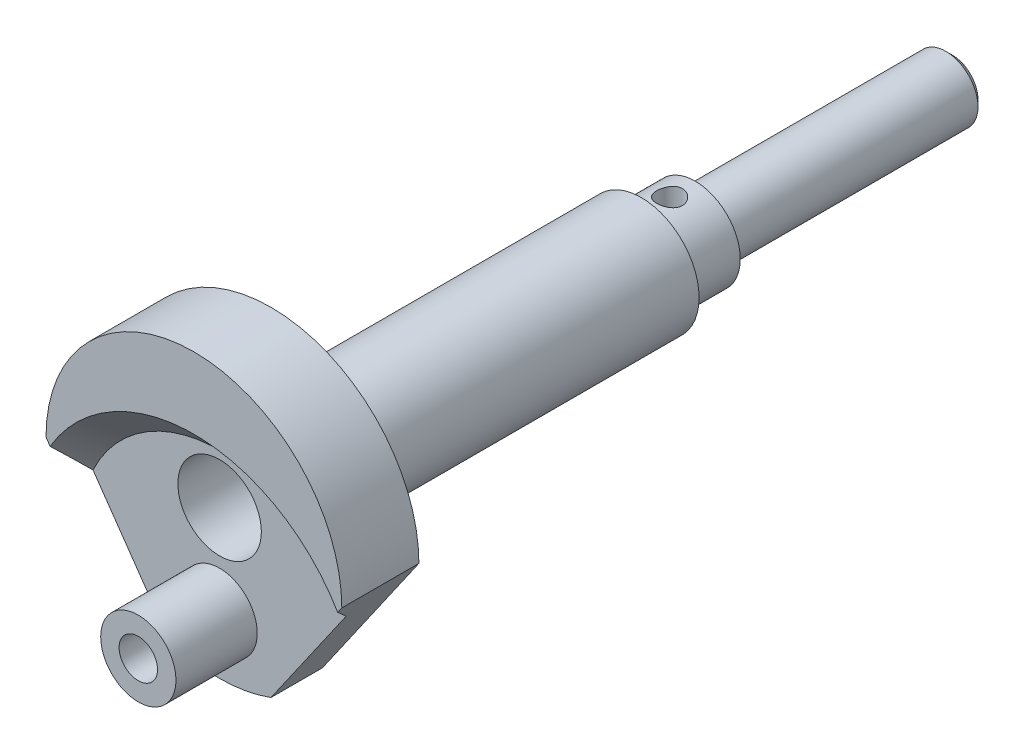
ISO-10303-21;
HEADER;
FILE_DESCRIPTION(('STEP AP214'),'2;1');
FILE_NAME('part.step','',(''),(''),'','','');
FILE_SCHEMA(('AUTOMOTIVE_DESIGN { 1 0 10303 214 1 1 1 1 }'));
ENDSEC;
DATA;
#1=APPLICATION_CONTEXT('core data for automotive mechanical design processes');
#2=APPLICATION_PROTOCOL_DEFINITION('international standard','automotive_design',2000,#1);
#3=PRODUCT_CONTEXT('',#1,'mechanical');
#4=PRODUCT('Part','Part','',(#3));
#5=PRODUCT_RELATED_PRODUCT_CATEGORY('part','',(#4));
#6=PRODUCT_DEFINITION_FORMATION('','',#4);
#7=PRODUCT_DEFINITION_CONTEXT('part definition',#1,'design');
#8=PRODUCT_DEFINITION('design','',#6,#7);
#9=PRODUCT_DEFINITION_SHAPE('','',#8);
#10=(LENGTH_UNIT() NAMED_UNIT(*) SI_UNIT(.MILLI.,.METRE.));
#11=(NAMED_UNIT(*) PLANE_ANGLE_UNIT() SI_UNIT($,.RADIAN.));
#12=(NAMED_UNIT(*) SI_UNIT($,.STERADIAN.) SOLID_ANGLE_UNIT());
#13=UNCERTAINTY_MEASURE_WITH_UNIT(LENGTH_MEASURE(1.E-05),#10,'distance_accuracy_value','');
#14=(GEOMETRIC_REPRESENTATION_CONTEXT(3) GLOBAL_UNCERTAINTY_ASSIGNED_CONTEXT((#13)) GLOBAL_UNIT_ASSIGNED_CONTEXT((#10,
#11,#12)) REPRESENTATION_CONTEXT('',''));
#15=CARTESIAN_POINT('',(0.,0.,0.));
#16=DIRECTION('',(0.,0.,1.));
#17=DIRECTION('',(1.,0.,0.));
#18=AXIS2_PLACEMENT_3D('',#15,#16,#17);
#19=CARTESIAN_POINT('',(0.,0.,-112.217199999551));
#20=DIRECTION('',(0.,0.,1.));
#21=DIRECTION('',(1.,0.,0.));
#22=AXIS2_PLACEMENT_3D('',#19,#20,#21);
#23=PLANE('',#22);
#24=CARTESIAN_POINT('',(0.,0.,-112.217199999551));
#25=DIRECTION('',(0.,0.,1.));
#26=DIRECTION('',(1.,0.,0.));
#27=AXIS2_PLACEMENT_3D('',#24,#25,#26);
#28=CIRCLE('',#27,4.2333333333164);
#29=CARTESIAN_POINT('',(4.2333333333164,0.,-112.217199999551));
#30=VERTEX_POINT('',#29);
#31=EDGE_CURVE('E20',#30,#30,#28,.T.);
#32=ORIENTED_EDGE('',*,*,#31,.F.);
#33=EDGE_LOOP('',(#32));
#34=FACE_BOUND('',#33,.T.);
#35=ADVANCED_FACE('F17',(#34),#23,.F.);
#36=CARTESIAN_POINT('',(0.,0.,-111.167333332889));
#37=DIRECTION('',(0.,0.,1.));
#38=DIRECTION('',(1.,0.,0.));
#39=AXIS2_PLACEMENT_3D('',#36,#37,#38);
#40=CONICAL_SURFACE('',#39,5.28319999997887,0.785398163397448);
#41=CARTESIAN_POINT('',(0.,0.,-111.167333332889));
#42=DIRECTION('',(0.,0.,-1.));
#43=DIRECTION('',(-1.,0.,0.));
#44=AXIS2_PLACEMENT_3D('',#41,#42,#43);
#45=CIRCLE('',#44,5.28319999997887);
#46=CARTESIAN_POINT('',(-5.28319999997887,0.,-111.167333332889));
#47=VERTEX_POINT('',#46);
#48=EDGE_CURVE('E145',#47,#47,#45,.F.);
#49=ORIENTED_EDGE('',*,*,#48,.F.);
#50=EDGE_LOOP('',(#49));
#51=FACE_BOUND('',#50,.T.);
#52=ORIENTED_EDGE('',*,*,#31,.T.);
#53=EDGE_LOOP('',(#52));
#54=FACE_BOUND('',#53,.T.);
#55=ADVANCED_FACE('F269',(#51,#54),#40,.T.);
#56=CARTESIAN_POINT('',(0.,-14.816582,22.5249570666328));
#57=DIRECTION('',(0.,0.,-1.));
#58=DIRECTION('',(-1.,0.,0.));
#59=AXIS2_PLACEMENT_3D('',#56,#57,#58);
#60=CYLINDRICAL_SURFACE('',#59,6.1976);
#61=CARTESIAN_POINT('',(0.,-14.816582,21.8555146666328));
#62=DIRECTION('',(0.,0.,-1.));
#63=DIRECTION('',(-1.,0.,0.));
#64=AXIS2_PLACEMENT_3D('',#61,#62,#63);
#65=CIRCLE('',#64,6.1976);
#66=CARTESIAN_POINT('',(-6.1976,-14.816582,21.8555146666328));
#67=VERTEX_POINT('',#66);
#68=EDGE_CURVE('E141',#67,#67,#65,.T.);
#69=ORIENTED_EDGE('',*,*,#68,.T.);
#70=EDGE_LOOP('',(#69));
#71=FACE_BOUND('',#70,.T.);
#72=CARTESIAN_POINT('',(0.,-14.816582,8.4666666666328));
#73=DIRECTION('',(0.,0.,-1.));
#74=DIRECTION('',(-1.,0.,0.));
#75=AXIS2_PLACEMENT_3D('',#72,#73,#74);
#76=CIRCLE('',#75,6.1976);
#77=CARTESIAN_POINT('',(-6.1976,-14.816582,8.4666666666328));
#78=VERTEX_POINT('',#77);
#79=EDGE_CURVE('E89',#78,#78,#76,.T.);
#80=ORIENTED_EDGE('',*,*,#79,.F.);
#81=EDGE_LOOP('',(#80));
#82=FACE_BOUND('',#81,.T.);
#83=ADVANCED_FACE('F260',(#71,#82),#60,.T.);
#84=CARTESIAN_POINT('',(0.,0.,-29.6333333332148));
#85=DIRECTION('',(0.,0.,1.));
#86=DIRECTION('',(1.,0.,0.));
#87=AXIS2_PLACEMENT_3D('',#84,#85,#86);
#88=CONICAL_SURFACE('',#87,6.87493333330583,1.0471975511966);
#89=CARTESIAN_POINT('',(0.,0.,-29.6333333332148));
#90=DIRECTION('',(0.,0.,1.));
#91=DIRECTION('',(1.,0.,0.));
#92=AXIS2_PLACEMENT_3D('',#89,#90,#91);
#93=CIRCLE('',#92,6.87493333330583);
#94=CARTESIAN_POINT('',(6.87493333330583,0.,-29.6333333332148));
#95=VERTEX_POINT('',#94);
#96=EDGE_CURVE('E137',#95,#95,#93,.T.);
#97=ORIENTED_EDGE('',*,*,#96,.T.);
#98=EDGE_LOOP('',(#97));
#99=FACE_BOUND('',#98,.T.);
#100=CARTESIAN_POINT('',(0.,0.,-33.6025779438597));
#101=VERTEX_POINT('',#100);
#102=VERTEX_LOOP('',#101);
#103=FACE_BOUND('',#102,.T.);
#104=ADVANCED_FACE('F257',(#99,#103),#88,.F.);
#105=CARTESIAN_POINT('',(0.,0.,-67.7671999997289));
#106=DIRECTION('',(0.,0.,-1.));
#107=DIRECTION('',(-1.,0.,0.));
#108=AXIS2_PLACEMENT_3D('',#105,#106,#107);
#109=CYLINDRICAL_SURFACE('',#108,5.28319999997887);
#110=CARTESIAN_POINT('',(0.,0.,-69.8838666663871));
#111=DIRECTION('',(0.,0.,-1.));
#112=DIRECTION('',(-1.,0.,0.));
#113=AXIS2_PLACEMENT_3D('',#110,#111,#112);
#114=CIRCLE('',#113,5.28319999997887);
#115=CARTESIAN_POINT('',(-5.28319999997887,0.,-69.8838666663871));
#116=VERTEX_POINT('',#115);
#117=EDGE_CURVE('E134',#116,#116,#114,.F.);
#118=ORIENTED_EDGE('',*,*,#117,.F.);
#119=EDGE_LOOP('',(#118));
#120=FACE_BOUND('',#119,.T.);
#121=ORIENTED_EDGE('',*,*,#48,.T.);
#122=EDGE_LOOP('',(#121));
#123=FACE_BOUND('',#122,.T.);
#124=ADVANCED_FACE('F259',(#120,#123),#109,.T.);
#125=CARTESIAN_POINT('',(0.,-14.816582,8.4666666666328));
#126=DIRECTION('',(0.,0.,1.));
#127=DIRECTION('',(1.,0.,0.));
#128=AXIS2_PLACEMENT_3D('',#125,#126,#127);
#129=PLANE('',#128);
#130=CARTESIAN_POINT('',(0.,0.,8.4666666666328));
#131=DIRECTION('',(0.,0.,1.));
#132=DIRECTION('',(1.,0.,0.));
#133=AXIS2_PLACEMENT_3D('',#130,#131,#132);
#134=CIRCLE('',#133,6.87493333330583);
#135=CARTESIAN_POINT('',(6.87493333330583,0.,8.4666666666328));
#136=VERTEX_POINT('',#135);
#137=EDGE_CURVE('E138',#136,#136,#134,.F.);
#138=ORIENTED_EDGE('',*,*,#137,.T.);
#139=EDGE_LOOP('',(#138));
#140=FACE_BOUND('',#139,.T.);
#141=ORIENTED_EDGE('',*,*,#79,.T.);
#142=EDGE_LOOP('',(#141));
#143=FACE_BOUND('',#142,.T.);
#144=CARTESIAN_POINT('',(0.,-14.816582,8.46666666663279));
#145=DIRECTION('',(0.,0.,1.));
#146=DIRECTION('',(1.,0.,0.));
#147=AXIS2_PLACEMENT_3D('',#144,#145,#146);
#148=CIRCLE('',#147,23.0293333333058);
#149=CARTESIAN_POINT('',(20.8522411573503,-5.04242052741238,8.4666666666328));
#150=VERTEX_POINT('',#149);
#151=CARTESIAN_POINT('',(-20.8522411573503,-5.04242052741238,8.4666666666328));
#152=VERTEX_POINT('',#151);
#153=EDGE_CURVE('E73',#150,#152,#148,.T.);
#154=ORIENTED_EDGE('',*,*,#153,.T.);
#155=DIRECTION('',(0.571160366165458,-0.820838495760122,0.));
#156=VECTOR('',#155,1.);
#157=CARTESIAN_POINT('',(-8.4666666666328,-22.8422486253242,8.4666666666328));
#158=LINE('',#157,#156);
#159=CARTESIAN_POINT('',(-8.4666666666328,-22.8422486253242,8.4666666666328));
#160=VERTEX_POINT('',#159);
#161=EDGE_CURVE('E133',#160,#152,#158,.F.);
#162=ORIENTED_EDGE('',*,*,#161,.F.);
#163=CARTESIAN_POINT('',(0.,0.,8.4666666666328));
#164=DIRECTION('',(0.,0.,1.));
#165=DIRECTION('',(1.,0.,0.));
#166=AXIS2_PLACEMENT_3D('',#163,#164,#165);
#167=CIRCLE('',#166,24.360886);
#168=CARTESIAN_POINT('',(8.4666666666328,-22.8422486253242,8.4666666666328));
#169=VERTEX_POINT('',#168);
#170=EDGE_CURVE('E76',#169,#160,#167,.F.);
#171=ORIENTED_EDGE('',*,*,#170,.F.);
#172=DIRECTION('',(-0.571160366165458,-0.820838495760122,0.));
#173=VECTOR('',#172,1.);
#174=CARTESIAN_POINT('',(8.4666666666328,-22.8422486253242,8.4666666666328));
#175=LINE('',#174,#173);
#176=EDGE_CURVE('E70',#169,#150,#175,.F.);
#177=ORIENTED_EDGE('',*,*,#176,.T.);
#178=EDGE_LOOP('',(#154,#162,#171,#177));
#179=FACE_BOUND('',#178,.T.);
#180=ADVANCED_FACE('F72',(#140,#143,#179),#129,.T.);
#181=CARTESIAN_POINT('',(0.,-14.816582,12.6999999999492));
#182=DIRECTION('',(0.,0.,1.));
#183=DIRECTION('',(1.,0.,0.));
#184=AXIS2_PLACEMENT_3D('',#181,#182,#183);
#185=CONICAL_SURFACE('',#184,27.4319153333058,0.804993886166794);
#186=CARTESIAN_POINT('',(20.8522411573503,-5.04242052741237,8.4666666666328));
#187=CARTESIAN_POINT('',(21.0907078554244,-4.69971004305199,8.81417631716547));
#188=CARTESIAN_POINT('',(21.3284180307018,-4.35808678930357,9.16327129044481));
#189=CARTESIAN_POINT('',(21.8025008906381,-3.67676244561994,9.86420706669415));
#190=CARTESIAN_POINT('',(22.0388736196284,-3.33706129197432,10.2160477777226));
#191=CARTESIAN_POINT('',(22.510471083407,-2.65930881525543,10.9220705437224));
#192=CARTESIAN_POINT('',(22.7456958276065,-2.32125747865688,11.2762525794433));
#193=CARTESIAN_POINT('',(23.2151468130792,-1.64658979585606,11.9866674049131));
#194=CARTESIAN_POINT('',(23.4493730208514,-1.30997349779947,12.3429002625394));
#195=CARTESIAN_POINT('',(23.6831659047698,-0.97397994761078,12.6999999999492));
#196=B_SPLINE_CURVE_WITH_KNOTS('',3,(#186,#187,#188,#189,#190,#191,#192,#193,#194,#195),
.UNSPECIFIED.,.F.,.F.,(4,2,2,2,4),(0.,1.62962797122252,3.25920160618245,4.88876185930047,
6.51837636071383),.UNSPECIFIED.);
#197=CARTESIAN_POINT('',(23.6831659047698,-0.973979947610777,12.6999999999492));
#198=VERTEX_POINT('',#197);
#199=EDGE_CURVE('E79',#150,#198,#196,.T.);
#200=ORIENTED_EDGE('',*,*,#199,.T.);
#201=CARTESIAN_POINT('',(0.,-14.816582,12.6999999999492));
#202=DIRECTION('',(0.,0.,1.));
#203=DIRECTION('',(1.,0.,0.));
#204=AXIS2_PLACEMENT_3D('',#201,#202,#203);
#205=CIRCLE('',#204,27.4319153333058);
#206=CARTESIAN_POINT('',(-23.6831659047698,-0.973979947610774,12.6999999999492));
#207=VERTEX_POINT('',#206);
#208=EDGE_CURVE('E88',#207,#198,#205,.F.);
#209=ORIENTED_EDGE('',*,*,#208,.F.);
#210=CARTESIAN_POINT('',(-20.8522411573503,-5.04242052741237,8.4666666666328));
#211=CARTESIAN_POINT('',(-21.0907078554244,-4.69971004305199,8.81417631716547));
#212=CARTESIAN_POINT('',(-21.3284180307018,-4.35808678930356,9.16327129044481));
#213=CARTESIAN_POINT('',(-21.8025008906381,-3.67676244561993,9.86420706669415));
#214=CARTESIAN_POINT('',(-22.0388736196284,-3.33706129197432,10.2160477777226));
#215=CARTESIAN_POINT('',(-22.510471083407,-2.65930881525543,10.9220705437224));
#216=CARTESIAN_POINT('',(-22.7456958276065,-2.32125747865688,11.2762525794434));
#217=CARTESIAN_POINT('',(-23.2151468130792,-1.64658979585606,11.9866674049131));
#218=CARTESIAN_POINT('',(-23.4493730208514,-1.30997349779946,12.3429002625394));
#219=CARTESIAN_POINT('',(-23.6831659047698,-0.973979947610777,12.6999999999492));
#220=B_SPLINE_CURVE_WITH_KNOTS('',3,(#210,#211,#212,#213,#214,#215,#216,#217,#218,#219),
.UNSPECIFIED.,.F.,.F.,(4,2,2,2,4),(0.,1.62962797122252,3.25920160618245,4.88876185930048,
6.51837636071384),.UNSPECIFIED.);
#221=EDGE_CURVE('E86',#152,#207,#220,.T.);
#222=ORIENTED_EDGE('',*,*,#221,.F.);
#223=ORIENTED_EDGE('',*,*,#153,.F.);
#224=EDGE_LOOP('',(#200,#209,#222,#223));
#225=FACE_BOUND('',#224,.T.);
#226=ADVANCED_FACE('F83',(#225),#185,.F.);
#227=CARTESIAN_POINT('',(0.,0.,12.6999999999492));
#228=DIRECTION('',(0.,0.,1.));
#229=DIRECTION('',(1.,0.,0.));
#230=AXIS2_PLACEMENT_3D('',#227,#228,#229);
#231=PLANE('',#230);
#232=CARTESIAN_POINT('',(0.,0.,12.6999999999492));
#233=DIRECTION('',(0.,0.,1.));
#234=DIRECTION('',(1.,0.,0.));
#235=AXIS2_PLACEMENT_3D('',#232,#233,#234);
#236=CIRCLE('',#235,24.360886);
#237=CARTESIAN_POINT('',(-24.360886,0.,12.6999999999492));
#238=VERTEX_POINT('',#237);
#239=CARTESIAN_POINT('',(24.360886,0.,12.6999999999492));
#240=VERTEX_POINT('',#239);
#241=EDGE_CURVE('E104',#238,#240,#236,.F.);
#242=ORIENTED_EDGE('',*,*,#241,.F.);
#243=DIRECTION('',(0.571160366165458,-0.820838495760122,0.));
#244=VECTOR('',#243,1.);
#245=CARTESIAN_POINT('',(-8.4666666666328,-22.8422486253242,12.6999999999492));
#246=LINE('',#245,#244);
#247=EDGE_CURVE('E132',#207,#238,#246,.F.);
#248=ORIENTED_EDGE('',*,*,#247,.F.);
#249=ORIENTED_EDGE('',*,*,#208,.T.);
#250=DIRECTION('',(-0.571160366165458,-0.820838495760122,0.));
#251=VECTOR('',#250,1.);
#252=CARTESIAN_POINT('',(8.4666666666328,-22.8422486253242,12.6999999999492));
#253=LINE('',#252,#251);
#254=EDGE_CURVE('E93',#198,#240,#253,.F.);
#255=ORIENTED_EDGE('',*,*,#254,.T.);
#256=EDGE_LOOP('',(#242,#248,#249,#255));
#257=FACE_BOUND('',#256,.T.);
#258=ADVANCED_FACE('F229',(#257),#231,.T.);
#259=CARTESIAN_POINT('',(0.,-14.816582,21.8555146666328));
#260=DIRECTION('',(0.,0.,-1.));
#261=DIRECTION('',(-1.,0.,0.));
#262=AXIS2_PLACEMENT_3D('',#259,#260,#261);
#263=PLANE('',#262);
#264=CARTESIAN_POINT('',(0.,-14.816582,21.8555146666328));
#265=DIRECTION('',(0.,0.,1.));
#266=DIRECTION('',(1.,0.,0.));
#267=AXIS2_PLACEMENT_3D('',#264,#265,#266);
#268=CIRCLE('',#267,3.16653333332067);
#269=CARTESIAN_POINT('',(3.16653333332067,-14.816582,21.8555146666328));
#270=VERTEX_POINT('',#269);
#271=EDGE_CURVE('E213',#270,#270,#268,.F.);
#272=ORIENTED_EDGE('',*,*,#271,.T.);
#273=EDGE_LOOP('',(#272));
#274=FACE_BOUND('',#273,.T.);
#275=ORIENTED_EDGE('',*,*,#68,.F.);
#276=EDGE_LOOP('',(#275));
#277=FACE_BOUND('',#276,.T.);
#278=ADVANCED_FACE('F226',(#274,#277),#263,.F.);
#279=CARTESIAN_POINT('',(0.,0.,-35.7060401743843));
#280=DIRECTION('',(0.,0.,1.));
#281=DIRECTION('',(1.,0.,0.));
#282=AXIS2_PLACEMENT_3D('',#279,#280,#281);
#283=CYLINDRICAL_SURFACE('',#282,6.87493333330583);
#284=ORIENTED_EDGE('',*,*,#137,.F.);
#285=EDGE_LOOP('',(#284));
#286=FACE_BOUND('',#285,.T.);
#287=ORIENTED_EDGE('',*,*,#96,.F.);
#288=EDGE_LOOP('',(#287));
#289=FACE_BOUND('',#288,.T.);
#290=CARTESIAN_POINT('',(2.62703810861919,-6.35321801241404,-12.4459999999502));
#291=CARTESIAN_POINT('',(2.62703500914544,-6.35321984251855,-12.3582359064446));
#292=CARTESIAN_POINT('',(2.62262089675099,-6.35505021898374,-12.2704461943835));
#293=CARTESIAN_POINT('',(2.60526067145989,-6.36218563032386,-12.0958348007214));
#294=CARTESIAN_POINT('',(2.59230785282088,-6.36749339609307,-12.009013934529));
#295=CARTESIAN_POINT('',(2.54161206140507,-6.38797792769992,-11.7505993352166));
#296=CARTESIAN_POINT('',(2.49203957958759,-6.40771083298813,-11.5816369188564));
#297=CARTESIAN_POINT('',(2.38437780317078,-6.44840248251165,-11.29290001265));
#298=CARTESIAN_POINT('',(2.33111210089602,-6.4679554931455,-11.1709784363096));
#299=CARTESIAN_POINT('',(2.21423527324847,-6.50889507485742,-10.9324216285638));
#300=CARTESIAN_POINT('',(2.15061610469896,-6.53028306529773,-10.8157905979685));
#301=CARTESIAN_POINT('',(2.01513531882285,-6.57335568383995,-10.5870717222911));
#302=CARTESIAN_POINT('',(1.94325002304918,-6.59504099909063,-10.4749982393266));
#303=CARTESIAN_POINT('',(1.7929460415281,-6.63748228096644,-10.255117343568));
#304=CARTESIAN_POINT('',(1.71452517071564,-6.65823793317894,-10.1473113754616));
#305=CARTESIAN_POINT('',(1.48236620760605,-6.71501221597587,-9.84417696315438));
#306=CARTESIAN_POINT('',(1.32196906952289,-6.74876714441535,-9.65349926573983));
#307=CARTESIAN_POINT('',(0.986924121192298,-6.80585737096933,-9.28330107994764));
#308=CARTESIAN_POINT('',(0.81226599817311,-6.82918504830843,-9.10378883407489));
#309=CARTESIAN_POINT('',(0.451582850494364,-6.86247370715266,-8.75568699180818));
#310=CARTESIAN_POINT('',(0.265572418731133,-6.87245148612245,-8.58708392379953));
#311=CARTESIAN_POINT('',(-0.116020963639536,-6.87660185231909,-8.26101202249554));
#312=CARTESIAN_POINT('',(-0.311598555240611,-6.87078319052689,-8.10353707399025));
#313=CARTESIAN_POINT('',(-0.659582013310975,-6.84483826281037,-7.83957236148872));
#314=CARTESIAN_POINT('',(-0.810219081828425,-6.82875710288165,-7.73035243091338));
#315=CARTESIAN_POINT('',(-1.11512579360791,-6.78564264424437,-7.51939689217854));
#316=CARTESIAN_POINT('',(-1.26939616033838,-6.75860714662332,-7.41766279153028));
#317=CARTESIAN_POINT('',(-1.73590755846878,-6.65973586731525,-7.12536257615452));
#318=CARTESIAN_POINT('',(-2.05260843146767,-6.57008898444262,-6.94711986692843));
#319=CARTESIAN_POINT('',(-2.62303454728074,-6.3605719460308,-6.66559203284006));
#320=CARTESIAN_POINT('',(-2.87645277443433,-6.25057205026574,-6.5544342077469));
#321=CARTESIAN_POINT('',(-3.25209421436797,-6.05874829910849,-6.41242359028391));
#322=CARTESIAN_POINT('',(-3.37659502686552,-5.99031319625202,-6.36919899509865));
#323=CARTESIAN_POINT('',(-3.62309037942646,-5.84451834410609,-6.29166528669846));
#324=CARTESIAN_POINT('',(-3.74508599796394,-5.76716253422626,-6.25735225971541));
#325=CARTESIAN_POINT('',(-3.98635375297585,-5.60313534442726,-6.19803417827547));
#326=CARTESIAN_POINT('',(-4.10560018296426,-5.516401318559,-6.17309742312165));
#327=CARTESIAN_POINT('',(-4.33929229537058,-5.33452603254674,-6.13337524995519));
#328=CARTESIAN_POINT('',(-4.45373796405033,-5.23938474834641,-6.11858986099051));
#329=CARTESIAN_POINT('',(-4.6766372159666,-5.04142662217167,-6.09949013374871));
#330=CARTESIAN_POINT('',(-4.78509311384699,-4.93861278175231,-6.09517172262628));
#331=CARTESIAN_POINT('',(-4.99501545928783,-4.72618466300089,-6.09709002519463));
#332=CARTESIAN_POINT('',(-5.09648250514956,-4.61657096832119,-6.10332583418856));
#333=CARTESIAN_POINT('',(-5.28083441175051,-4.40398291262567,-6.12495185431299));
#334=CARTESIAN_POINT('',(-5.36453589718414,-4.30160297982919,-6.13926057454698));
#335=CARTESIAN_POINT('',(-5.52528737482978,-4.09307286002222,-6.17589086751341));
#336=CARTESIAN_POINT('',(-5.60233517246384,-3.98692144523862,-6.19821507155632));
#337=CARTESIAN_POINT('',(-5.74941549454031,-3.77172470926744,-6.25052169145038));
#338=CARTESIAN_POINT('',(-5.81944947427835,-3.66267999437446,-6.28050251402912));
#339=CARTESIAN_POINT('',(-5.95237292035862,-3.4424611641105,-6.34768718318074));
#340=CARTESIAN_POINT('',(-6.01525956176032,-3.33128622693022,-6.38489387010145));
#341=CARTESIAN_POINT('',(-6.1978700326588,-2.98669117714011,-6.50992078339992));
#342=CARTESIAN_POINT('',(-6.3056586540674,-2.75087355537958,-6.60901765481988));
#343=CARTESIAN_POINT('',(-6.49102567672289,-2.27940511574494,-6.83171728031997));
#344=CARTESIAN_POINT('',(-6.56860267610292,-2.04375430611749,-6.95532117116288));
#345=CARTESIAN_POINT('',(-6.7179573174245,-1.49643820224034,-7.26890369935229));
#346=CARTESIAN_POINT('',(-6.77862973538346,-1.18640833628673,-7.46711037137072));
#347=CARTESIAN_POINT('',(-6.83751168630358,-0.732545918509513,-7.78624593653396));
#348=CARTESIAN_POINT('',(-6.85178051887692,-0.58282073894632,-7.89651576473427));
#349=CARTESIAN_POINT('',(-6.87049095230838,-0.287868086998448,-8.12370810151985));
#350=CARTESIAN_POINT('',(-6.87493420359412,-0.142639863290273,-8.24062948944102));
#351=CARTESIAN_POINT('',(-6.87493206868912,0.20727011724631,-8.53503353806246));
#352=CARTESIAN_POINT('',(-6.86554703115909,0.409074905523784,-8.7159525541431));
#353=CARTESIAN_POINT('',(-6.83109565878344,0.79956583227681,-9.09040964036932));
#354=CARTESIAN_POINT('',(-6.80601018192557,0.988235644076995,-9.28396285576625));
#355=CARTESIAN_POINT('',(-6.74383898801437,1.34851895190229,-9.6836882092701));
#356=CARTESIAN_POINT('',(-6.70678835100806,1.52018041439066,-9.88982204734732));
#357=CARTESIAN_POINT('',(-6.64615893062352,1.7607293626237,-10.2104357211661));
#358=CARTESIAN_POINT('',(-6.62512513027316,1.8380351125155,-10.3191204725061));
#359=CARTESIAN_POINT('',(-6.58233154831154,1.98582700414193,-10.5408713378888));
#360=CARTESIAN_POINT('',(-6.56057211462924,2.05631635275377,-10.6539353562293));
#361=CARTESIAN_POINT('',(-6.52430502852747,2.1680522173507,-10.8489015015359));
#362=CARTESIAN_POINT('',(-6.50965903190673,2.21154663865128,-10.929482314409));
#363=CARTESIAN_POINT('',(-6.48115189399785,2.29374634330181,-11.0931668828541));
#364=CARTESIAN_POINT('',(-6.46729082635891,2.3324511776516,-11.1762708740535));
#365=CARTESIAN_POINT('',(-6.42792914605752,2.43971241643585,-11.4290367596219));
#366=CARTESIAN_POINT('',(-6.40449692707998,2.49986858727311,-11.6029096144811));
#367=CARTESIAN_POINT('',(-6.37624441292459,2.5708117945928,-11.8896918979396));
#368=CARTESIAN_POINT('',(-6.36772879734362,2.59170898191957,-11.9997362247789));
#369=CARTESIAN_POINT('',(-6.35621957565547,2.61981393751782,-12.2218647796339));
#370=CARTESIAN_POINT('',(-6.35322216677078,2.62703113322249,-12.33394754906));
#371=CARTESIAN_POINT('',(-6.35321475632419,2.62704357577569,-12.5338241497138));
#372=CARTESIAN_POINT('',(-6.35505027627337,2.62261975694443,-12.6216296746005));
#373=CARTESIAN_POINT('',(-6.36219274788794,2.60524435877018,-12.7962646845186));
#374=CARTESIAN_POINT('',(-6.36750123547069,2.59228900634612,-12.8830937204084));
#375=CARTESIAN_POINT('',(-6.38798557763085,2.54159201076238,-13.1414797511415));
#376=CARTESIAN_POINT('',(-6.40771563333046,2.4920266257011,-13.3104001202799));
#377=CARTESIAN_POINT('',(-6.44840897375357,2.38436082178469,-13.5991437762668));
#378=CARTESIAN_POINT('',(-6.46796959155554,2.33107382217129,-13.7211086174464));
#379=CARTESIAN_POINT('',(-6.50892482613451,2.21414835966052,-13.9597468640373));
#380=CARTESIAN_POINT('',(-6.53032084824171,2.15050193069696,-14.0764161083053));
#381=CARTESIAN_POINT('',(-6.57340036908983,2.01499007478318,-14.3051594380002));
#382=CARTESIAN_POINT('',(-6.5950844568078,1.9431043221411,-14.417221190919));
#383=CARTESIAN_POINT('',(-6.63750816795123,1.79284612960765,-14.6370225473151));
#384=CARTESIAN_POINT('',(-6.65824801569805,1.714475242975,-14.744763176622));
#385=CARTESIAN_POINT('',(-6.70699474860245,1.51516357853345,-15.0049852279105));
#386=CARTESIAN_POINT('',(-6.73397362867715,1.3911797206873,-15.1553309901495));
#387=CARTESIAN_POINT('',(-6.78202757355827,1.1340024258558,-15.4489556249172));
#388=CARTESIAN_POINT('',(-6.80310080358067,1.00080614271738,-15.5922322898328));
#389=CARTESIAN_POINT('',(-6.83780016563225,0.72680900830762,-15.8720090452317));
#390=CARTESIAN_POINT('',(-6.85143327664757,0.586015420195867,-16.0085153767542));
#391=CARTESIAN_POINT('',(-6.87000016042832,0.297781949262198,-16.2749402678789));
#392=CARTESIAN_POINT('',(-6.87493411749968,0.150342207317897,-16.4048589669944));
#393=CARTESIAN_POINT('',(-6.87493253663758,-0.15273375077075,-16.6598682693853));
#394=CARTESIAN_POINT('',(-6.86983875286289,-0.308463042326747,-16.7848491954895));
#395=CARTESIAN_POINT('',(-6.84830576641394,-0.624995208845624,-17.0271226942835));
#396=CARTESIAN_POINT('',(-6.83186541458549,-0.785798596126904,-17.144414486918));
#397=CARTESIAN_POINT('',(-6.76378394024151,-1.27427989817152,-17.4833495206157));
#398=CARTESIAN_POINT('',(-6.69339080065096,-1.60857360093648,-17.6925110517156));
#399=CARTESIAN_POINT('',(-6.51582497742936,-2.21000362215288,-18.0255874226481));
#400=CARTESIAN_POINT('',(-6.42017294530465,-2.47570862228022,-18.1581308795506));
#401=CARTESIAN_POINT('',(-6.24777718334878,-2.87242656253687,-18.3322056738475));
#402=CARTESIAN_POINT('',(-6.18547505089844,-3.00438874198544,-18.3861165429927));
#403=CARTESIAN_POINT('',(-6.05105872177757,-3.26666177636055,-18.4848861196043));
#404=CARTESIAN_POINT('',(-5.97894888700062,-3.39697333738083,-18.5297488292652));
#405=CARTESIAN_POINT('',(-5.82421647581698,-3.65597800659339,-18.6100156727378));
#406=CARTESIAN_POINT('',(-5.74150390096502,-3.78464546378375,-18.6453296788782));
#407=CARTESIAN_POINT('',(-5.56636317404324,-4.037820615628,-18.7052412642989));
#408=CARTESIAN_POINT('',(-5.47393497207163,-4.1623282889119,-18.7298387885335));
#409=CARTESIAN_POINT('',(-5.27999542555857,-4.40574117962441,-18.7677554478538));
#410=CARTESIAN_POINT('',(-5.17849020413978,-4.52465009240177,-18.7810821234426));
#411=CARTESIAN_POINT('',(-4.967201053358,-4.75563989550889,-18.7961668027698));
#412=CARTESIAN_POINT('',(-4.857418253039,-4.86772171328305,-18.7979263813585));
#413=CARTESIAN_POINT('',(-4.64631428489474,-5.06899620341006,-18.7904008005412));
#414=CARTESIAN_POINT('',(-4.54591208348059,-5.15921457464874,-18.7826043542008));
#415=CARTESIAN_POINT('',(-4.34054199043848,-5.33315252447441,-18.7585269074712));
#416=CARTESIAN_POINT('',(-4.2355726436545,-5.41687000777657,-18.7422431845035));
#417=CARTESIAN_POINT('',(-4.02199467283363,-5.57728368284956,-18.701471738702));
#418=CARTESIAN_POINT('',(-3.91338741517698,-5.65398247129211,-18.6769870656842));
#419=CARTESIAN_POINT('',(-3.6933448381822,-5.80011975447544,-18.6202083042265));
#420=CARTESIAN_POINT('',(-3.58190845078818,-5.86955545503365,-18.5879112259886));
#421=CARTESIAN_POINT('',(-3.24410154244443,-6.06700062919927,-18.479815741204));
#422=CARTESIAN_POINT('',(-3.01462563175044,-6.18385647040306,-18.3928898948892));
#423=CARTESIAN_POINT('',(-2.55370493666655,-6.3880379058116,-18.1937690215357));
#424=CARTESIAN_POINT('',(-2.32225923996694,-6.47534895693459,-18.0815615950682));
#425=CARTESIAN_POINT('',(-1.92110515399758,-6.60350882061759,-17.8676100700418));
#426=CARTESIAN_POINT('',(-1.75079194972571,-6.65053090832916,-17.7705673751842));
#427=CARTESIAN_POINT('',(-1.41298024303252,-6.73040249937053,-17.5662786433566));
#428=CARTESIAN_POINT('',(-1.24548204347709,-6.76325048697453,-17.4590315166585));
#429=CARTESIAN_POINT('',(-0.914155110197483,-6.81595423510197,-17.2353528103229));
#430=CARTESIAN_POINT('',(-0.750334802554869,-6.83578262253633,-17.1189024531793));
#431=CARTESIAN_POINT('',(-0.427716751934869,-6.8635249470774,-16.8779904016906));
#432=CARTESIAN_POINT('',(-0.268918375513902,-6.87144039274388,-16.7535297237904));
#433=CARTESIAN_POINT('',(0.046419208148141,-6.87662639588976,-16.4942782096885));
#434=CARTESIAN_POINT('',(0.202819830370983,-6.87364493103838,-16.3593143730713));
#435=CARTESIAN_POINT('',(0.508481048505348,-6.85781108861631,-16.0820820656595));
#436=CARTESIAN_POINT('',(0.657741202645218,-6.84495810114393,-15.9398131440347));
#437=CARTESIAN_POINT('',(0.947797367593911,-6.81084942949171,-15.6481302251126));
#438=CARTESIAN_POINT('',(1.08860186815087,-6.7896023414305,-15.4987236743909));
#439=CARTESIAN_POINT('',(1.36021304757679,-6.74044344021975,-15.1922422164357));
#440=CARTESIAN_POINT('',(1.49102379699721,-6.71253435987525,-15.0351704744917));
#441=CARTESIAN_POINT('',(1.75352722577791,-6.64904796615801,-14.6950650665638));
#442=CARTESIAN_POINT('',(1.88384810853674,-6.61297170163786,-14.5110430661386));
#443=CARTESIAN_POINT('',(2.06345621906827,-6.55826367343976,-14.2251513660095));
#444=CARTESIAN_POINT('',(2.12068160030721,-6.5399281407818,-14.1282078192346));
#445=CARTESIAN_POINT('',(2.2286100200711,-6.50393998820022,-13.930651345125));
#446=CARTESIAN_POINT('',(2.27931507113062,-6.48628715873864,-13.8300395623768));
#447=CARTESIAN_POINT('',(2.39427624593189,-6.4449493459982,-13.5773891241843));
#448=CARTESIAN_POINT('',(2.45398609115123,-6.4222405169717,-13.4230465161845));
#449=CARTESIAN_POINT('',(2.54940844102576,-6.38497914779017,-13.1063334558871));
#450=CARTESIAN_POINT('',(2.58521936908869,-6.37039319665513,-12.9439989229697));
#451=CARTESIAN_POINT('',(2.6129379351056,-6.35903303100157,-12.7243270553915));
#452=CARTESIAN_POINT('',(2.61820917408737,-6.35686240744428,-12.6688226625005));
#453=CARTESIAN_POINT('',(2.62526025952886,-6.3539543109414,-12.5575489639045));
#454=CARTESIAN_POINT('',(2.62704007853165,-6.35321684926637,-12.5017796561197));
#455=CARTESIAN_POINT('',(2.62703810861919,-6.35321801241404,-12.4459999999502));
#456=B_SPLINE_CURVE_WITH_KNOTS('',3,(#290,#291,#292,#293,#294,#295,#296,#297,#298,#299,#300,
#301,#302,#303,#304,#305,#306,#307,#308,#309,#310,#311,#312,#313,#314,#315,#316,#317,#318,#319,
#320,#321,#322,#323,#324,#325,#326,#327,#328,#329,#330,#331,#332,#333,#334,#335,#336,#337,#338,
#339,#340,#341,#342,#343,#344,#345,#346,#347,#348,#349,#350,#351,#352,#353,#354,#355,#356,#357,
#358,#359,#360,#361,#362,#363,#364,#365,#366,#367,#368,#369,#370,#371,#372,#373,#374,#375,#376,
#377,#378,#379,#380,#381,#382,#383,#384,#385,#386,#387,#388,#389,#390,#391,#392,#393,#394,#395,
#396,#397,#398,#399,#400,#401,#402,#403,#404,#405,#406,#407,#408,#409,#410,#411,#412,#413,#414,
#415,#416,#417,#418,#419,#420,#421,#422,#423,#424,#425,#426,#427,#428,#429,#430,#431,#432,#433,
#434,#435,#436,#437,#438,#439,#440,#441,#442,#443,#444,#445,#446,#447,#448,#449,#450,#451,#452,
#453,#454,#455),.UNSPECIFIED.,.T.,.F.,(4,2,2,2,2,2,2,2,2,2,2,2,2,2,2,2,2,2,2,2,2,2,2,2,2,2,2,2,
2,2,2,2,2,2,2,2,2,2,2,2,2,2,2,2,2,2,2,2,2,2,2,2,2,2,2,2,2,2,2,2,2,2,2,2,2,2,2,2,2,2,2,2,2,2,2,2,
2,2,2,2,2,2,4),(0.,0.263206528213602,0.526620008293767,1.05516501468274,1.45810392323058,
1.86135736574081,2.26579614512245,2.6703706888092,3.42364957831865,4.17747810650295,
4.93035723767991,5.68281937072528,6.2426064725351,6.80250599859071,7.91946591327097,
8.8090015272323,9.25402165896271,9.6988460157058,10.1468505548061,10.5948563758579,
11.0426878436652,11.4904809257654,11.889057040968,12.2877641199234,12.6863882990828,
13.0851694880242,13.9144747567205,14.7438185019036,15.8574751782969,16.4166481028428,
16.9757270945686,17.7881252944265,18.6015159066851,19.4125431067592,19.817429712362,
20.2221248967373,20.5001687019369,20.778238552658,21.3317085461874,21.6678899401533,
22.0038395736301,22.2671492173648,22.5305753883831,23.0590048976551,23.4620881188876,
23.8654827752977,24.269894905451,24.6742104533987,25.2639034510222,25.8537794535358,
26.4431011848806,27.0324104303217,27.6310940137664,28.2298382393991,29.4252113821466,
30.3572122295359,30.8234223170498,31.2894257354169,31.7596851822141,32.2299470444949,
32.6998940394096,33.1697770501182,33.574903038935,33.9801590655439,34.3852645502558,
34.7905253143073,35.6025144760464,36.4149027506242,37.0188639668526,37.622889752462,
38.2281814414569,38.8333964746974,39.4526964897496,40.0720347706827,40.6907404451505,
41.3091927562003,41.9930970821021,42.3350707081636,42.6769385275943,43.1765868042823,
43.6741644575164,43.8414476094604,44.0087320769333),.UNSPECIFIED.);
#457=CARTESIAN_POINT('',(2.62703810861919,-6.35321801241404,-12.4459999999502));
#458=VERTEX_POINT('',#457);
#459=EDGE_CURVE('E209',#458,#458,#456,.T.);
#460=ORIENTED_EDGE('',*,*,#459,.T.);
#461=EDGE_LOOP('',(#460));
#462=FACE_BOUND('',#461,.T.);
#463=ADVANCED_FACE('F221',(#286,#289,#462),#283,.F.);
#464=CARTESIAN_POINT('',(0.,0.,-69.8838666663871));
#465=DIRECTION('',(0.,0.,-1.));
#466=DIRECTION('',(-1.,0.,0.));
#467=AXIS2_PLACEMENT_3D('',#464,#465,#466);
#468=PLANE('',#467);
#469=ORIENTED_EDGE('',*,*,#117,.T.);
#470=EDGE_LOOP('',(#469));
#471=FACE_BOUND('',#470,.T.);
#472=CARTESIAN_POINT('',(0.,0.,-69.8838666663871));
#473=DIRECTION('',(0.,0.,-1.));
#474=DIRECTION('',(-1.,0.,0.));
#475=AXIS2_PLACEMENT_3D('',#472,#473,#474);
#476=CIRCLE('',#475,7.4083333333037);
#477=CARTESIAN_POINT('',(-7.4083333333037,0.,-69.8838666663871));
#478=VERTEX_POINT('',#477);
#479=EDGE_CURVE('E203',#478,#478,#476,.F.);
#480=ORIENTED_EDGE('',*,*,#479,.F.);
#481=EDGE_LOOP('',(#480));
#482=FACE_BOUND('',#481,.T.);
#483=ADVANCED_FACE('F225',(#471,#482),#468,.T.);
#484=CARTESIAN_POINT('',(0.,-29.2330632,-65.6505333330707));
#485=DIRECTION('',(0.,1.,0.));
#486=DIRECTION('',(0.,0.,1.));
#487=AXIS2_PLACEMENT_3D('',#484,#485,#486);
#488=CYLINDRICAL_SURFACE('',#487,2.1166666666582);
#489=CARTESIAN_POINT('',(0.,7.4083333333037,-63.5338666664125));
#490=CARTESIAN_POINT('',(-0.11631233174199,7.40833005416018,-63.5338716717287));
#491=CARTESIAN_POINT('',(-0.232687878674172,7.40556597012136,-63.5434905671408));
#492=CARTESIAN_POINT('',(-0.462109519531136,7.39480117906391,-63.5816489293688));
#493=CARTESIAN_POINT('',(-0.575152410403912,7.38679559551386,-63.6102060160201));
#494=CARTESIAN_POINT('',(-0.794501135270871,7.36642982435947,-63.6852195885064));
#495=CARTESIAN_POINT('',(-0.900817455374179,7.35407662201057,-63.7316473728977));
#496=CARTESIAN_POINT('',(-1.10413976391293,7.32631021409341,-63.8409802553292));
#497=CARTESIAN_POINT('',(-1.20114603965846,7.31089710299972,-63.903884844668));
#498=CARTESIAN_POINT('',(-1.38566033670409,7.2782101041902,-64.0461295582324));
#499=CARTESIAN_POINT('',(-1.47288978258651,7.26090085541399,-64.1258228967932));
#500=CARTESIAN_POINT('',(-1.63296334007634,7.2265864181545,-64.2986507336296));
#501=CARTESIAN_POINT('',(-1.70580237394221,7.20958133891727,-64.3917899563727));
#502=CARTESIAN_POINT('',(-1.83644995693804,7.17742884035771,-64.5911814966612));
#503=CARTESIAN_POINT('',(-1.89391987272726,7.16232663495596,-64.6976634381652));
#504=CARTESIAN_POINT('',(-1.98997259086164,7.13623939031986,-64.9192148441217));
#505=CARTESIAN_POINT('',(-2.02857796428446,7.1252494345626,-65.0342738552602));
#506=CARTESIAN_POINT('',(-2.07683819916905,7.11129745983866,-65.2333314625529));
#507=CARTESIAN_POINT('',(-2.09174596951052,7.1069057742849,-65.3159939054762));
#508=CARTESIAN_POINT('',(-2.11166176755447,7.10101365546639,-65.4826043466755));
#509=CARTESIAN_POINT('',(-2.11667034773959,7.09951306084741,-65.566552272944));
#510=CARTESIAN_POINT('',(-2.11666157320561,7.09951965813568,-65.7667365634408));
#511=CARTESIAN_POINT('',(-2.10706010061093,7.10240179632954,-65.8830032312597));
#512=CARTESIAN_POINT('',(-2.06897724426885,7.11358649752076,-66.1121983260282));
#513=CARTESIAN_POINT('',(-2.04047785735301,7.1218942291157,-66.225123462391));
#514=CARTESIAN_POINT('',(-1.96563283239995,7.14291170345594,-66.4442225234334));
#515=CARTESIAN_POINT('',(-1.91931852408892,7.15561371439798,-66.5504079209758));
#516=CARTESIAN_POINT('',(-1.81025342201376,7.18397847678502,-66.7535077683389));
#517=CARTESIAN_POINT('',(-1.74750287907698,7.19964118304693,-66.8504223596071));
#518=CARTESIAN_POINT('',(-1.60541956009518,7.23266719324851,-67.0350264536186));
#519=CARTESIAN_POINT('',(-1.52569885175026,7.25006407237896,-67.1224114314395));
#520=CARTESIAN_POINT('',(-1.35274935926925,7.2843140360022,-67.2827890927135));
#521=CARTESIAN_POINT('',(-1.25951627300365,7.30116694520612,-67.3557771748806));
#522=CARTESIAN_POINT('',(-1.06002909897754,7.33281144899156,-67.4865922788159));
#523=CARTESIAN_POINT('',(-0.953561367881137,7.34755782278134,-67.5441050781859));
#524=CARTESIAN_POINT('',(-0.732039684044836,7.37291636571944,-67.640241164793));
#525=CARTESIAN_POINT('',(-0.616995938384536,7.3835333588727,-67.6788865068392));
#526=CARTESIAN_POINT('',(-0.417834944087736,7.39699478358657,-67.7272499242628));
#527=CARTESIAN_POINT('',(-0.3350448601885,7.40122407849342,-67.7422036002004));
#528=CARTESIAN_POINT('',(-0.168180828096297,7.40689447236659,-67.7621802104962));
#529=CARTESIAN_POINT('',(-0.0841069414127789,7.40833570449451,-67.7672036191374));
#530=CARTESIAN_POINT('',(0.11631233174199,7.40833005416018,-67.7671949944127));
#531=CARTESIAN_POINT('',(0.232687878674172,7.40556597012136,-67.7575760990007));
#532=CARTESIAN_POINT('',(0.462109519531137,7.39480117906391,-67.7194177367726));
#533=CARTESIAN_POINT('',(0.575152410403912,7.38679559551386,-67.6908606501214));
#534=CARTESIAN_POINT('',(0.794501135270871,7.36642982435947,-67.615847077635));
#535=CARTESIAN_POINT('',(0.900817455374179,7.35407662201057,-67.5694192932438));
#536=CARTESIAN_POINT('',(1.10413976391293,7.32631021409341,-67.4600864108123));
#537=CARTESIAN_POINT('',(1.20114603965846,7.31089710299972,-67.3971818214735));
#538=CARTESIAN_POINT('',(1.38566033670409,7.2782101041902,-67.254937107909));
#539=CARTESIAN_POINT('',(1.47288978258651,7.26090085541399,-67.1752437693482));
#540=CARTESIAN_POINT('',(1.63296334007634,7.2265864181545,-67.0024159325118));
#541=CARTESIAN_POINT('',(1.70580237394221,7.20958133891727,-66.9092767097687));
#542=CARTESIAN_POINT('',(1.83644995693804,7.17742884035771,-66.7098851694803));
#543=CARTESIAN_POINT('',(1.89391987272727,7.16232663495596,-66.6034032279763));
#544=CARTESIAN_POINT('',(1.98997259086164,7.13623939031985,-66.3818518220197));
#545=CARTESIAN_POINT('',(2.02857796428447,7.1252494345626,-66.2667928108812));
#546=CARTESIAN_POINT('',(2.07683819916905,7.11129745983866,-66.0677352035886));
#547=CARTESIAN_POINT('',(2.09174596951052,7.1069057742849,-65.9850727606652));
#548=CARTESIAN_POINT('',(2.11166176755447,7.1010136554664,-65.8184623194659));
#549=CARTESIAN_POINT('',(2.11667034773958,7.09951306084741,-65.7345143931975));
#550=CARTESIAN_POINT('',(2.11666157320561,7.09951965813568,-65.5343301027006));
#551=CARTESIAN_POINT('',(2.10706010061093,7.10240179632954,-65.4180634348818));
#552=CARTESIAN_POINT('',(2.06897724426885,7.11358649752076,-65.1888683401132));
#553=CARTESIAN_POINT('',(2.04047785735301,7.1218942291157,-65.0759432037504));
#554=CARTESIAN_POINT('',(1.96563283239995,7.14291170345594,-64.856844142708));
#555=CARTESIAN_POINT('',(1.91931852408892,7.15561371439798,-64.7506587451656));
#556=CARTESIAN_POINT('',(1.81025342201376,7.18397847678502,-64.5475588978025));
#557=CARTESIAN_POINT('',(1.74750287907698,7.19964118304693,-64.4506443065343));
#558=CARTESIAN_POINT('',(1.60541956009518,7.23266719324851,-64.2660402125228));
#559=CARTESIAN_POINT('',(1.52569885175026,7.25006407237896,-64.1786552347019));
#560=CARTESIAN_POINT('',(1.35274935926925,7.2843140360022,-64.018277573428));
#561=CARTESIAN_POINT('',(1.25951627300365,7.30116694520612,-63.9452894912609));
#562=CARTESIAN_POINT('',(1.06002909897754,7.33281144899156,-63.8144743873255));
#563=CARTESIAN_POINT('',(0.953561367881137,7.34755782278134,-63.7569615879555));
#564=CARTESIAN_POINT('',(0.732039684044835,7.37291636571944,-63.6608255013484));
#565=CARTESIAN_POINT('',(0.616995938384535,7.3835333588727,-63.6221801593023));
#566=CARTESIAN_POINT('',(0.417834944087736,7.39699478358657,-63.5738167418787));
#567=CARTESIAN_POINT('',(0.3350448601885,7.40122407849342,-63.558863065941));
#568=CARTESIAN_POINT('',(0.168180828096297,7.40689447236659,-63.5388864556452));
#569=CARTESIAN_POINT('',(0.0841069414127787,7.40833570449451,-63.533863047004));
#570=CARTESIAN_POINT('',(0.,7.4083333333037,-63.5338666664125));
#571=B_SPLINE_CURVE_WITH_KNOTS('',3,(#489,#490,#491,#492,#493,#494,#495,#496,#497,#498,#499,
#500,#501,#502,#503,#504,#505,#506,#507,#508,#509,#510,#511,#512,#513,#514,#515,#516,#517,#518,
#519,#520,#521,#522,#523,#524,#525,#526,#527,#528,#529,#530,#531,#532,#533,#534,#535,#536,#537,
#538,#539,#540,#541,#542,#543,#544,#545,#546,#547,#548,#549,#550,#551,#552,#553,#554,#555,#556,
#557,#558,#559,#560,#561,#562,#563,#564,#565,#566,#567,#568,#569,#570),.UNSPECIFIED.,.T.,.F.,(4,
2,2,2,2,2,2,2,2,2,2,2,2,2,2,2,2,2,2,2,2,2,2,2,2,2,2,2,2,2,2,2,2,2,2,2,2,2,2,2,4),(0.,
0.348623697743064,0.697572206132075,1.04596260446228,1.39434224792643,1.75095325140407,
2.10768986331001,2.47173755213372,2.83534859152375,3.08707891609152,3.33879519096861,
3.68709091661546,4.03571892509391,4.38373661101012,4.73174898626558,5.08878914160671,
5.44594322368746,5.80987952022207,6.1733893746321,6.42549569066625,6.67758996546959,
7.02621366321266,7.37516217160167,7.72355256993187,8.07193221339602,8.42854321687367,
8.7852798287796,9.14932751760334,9.51293855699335,9.76466888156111,10.0163851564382,
10.364680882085,10.7133088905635,11.0613265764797,11.4093389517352,11.7663791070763,
12.123533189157,12.4874694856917,12.8509793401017,13.1030856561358,13.3551799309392),.UNSPECIFIED.);
#572=CARTESIAN_POINT('',(0.,7.4083333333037,-63.5338666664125));
#573=VERTEX_POINT('',#572);
#574=EDGE_CURVE('E191',#573,#573,#571,.T.);
#575=ORIENTED_EDGE('',*,*,#574,.F.);
#576=EDGE_LOOP('',(#575));
#577=FACE_BOUND('',#576,.T.);
#578=CARTESIAN_POINT('',(2.1166666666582,-7.09951582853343,-65.6505333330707));
#579=CARTESIAN_POINT('',(2.11666157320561,-7.09951965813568,-65.7667365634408));
#580=CARTESIAN_POINT('',(2.10706010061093,-7.10240179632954,-65.8830032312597));
#581=CARTESIAN_POINT('',(2.06897724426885,-7.11358649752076,-66.1121983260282));
#582=CARTESIAN_POINT('',(2.04047785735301,-7.1218942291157,-66.225123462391));
#583=CARTESIAN_POINT('',(1.96563283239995,-7.14291170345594,-66.4442225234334));
#584=CARTESIAN_POINT('',(1.91931852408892,-7.15561371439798,-66.5504079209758));
#585=CARTESIAN_POINT('',(1.81025342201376,-7.18397847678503,-66.7535077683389));
#586=CARTESIAN_POINT('',(1.74750287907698,-7.19964118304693,-66.8504223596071));
#587=CARTESIAN_POINT('',(1.60541956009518,-7.23266719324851,-67.0350264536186));
#588=CARTESIAN_POINT('',(1.52569885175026,-7.25006407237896,-67.1224114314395));
#589=CARTESIAN_POINT('',(1.35274935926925,-7.2843140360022,-67.2827890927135));
#590=CARTESIAN_POINT('',(1.25951627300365,-7.30116694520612,-67.3557771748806));
#591=CARTESIAN_POINT('',(1.06002909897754,-7.33281144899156,-67.4865922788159));
#592=CARTESIAN_POINT('',(0.953561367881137,-7.34755782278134,-67.5441050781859));
#593=CARTESIAN_POINT('',(0.732039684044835,-7.37291636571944,-67.640241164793));
#594=CARTESIAN_POINT('',(0.616995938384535,-7.3835333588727,-67.6788865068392));
#595=CARTESIAN_POINT('',(0.417834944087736,-7.39699478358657,-67.7272499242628));
#596=CARTESIAN_POINT('',(0.3350448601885,-7.40122407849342,-67.7422036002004));
#597=CARTESIAN_POINT('',(0.168180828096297,-7.40689447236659,-67.7621802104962));
#598=CARTESIAN_POINT('',(0.0841069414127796,-7.40833570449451,-67.7672036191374));
#599=CARTESIAN_POINT('',(-0.116312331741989,-7.40833005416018,-67.7671949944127));
#600=CARTESIAN_POINT('',(-0.232687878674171,-7.40556597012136,-67.7575760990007));
#601=CARTESIAN_POINT('',(-0.462109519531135,-7.39480117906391,-67.7194177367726));
#602=CARTESIAN_POINT('',(-0.57515241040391,-7.38679559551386,-67.6908606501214));
#603=CARTESIAN_POINT('',(-0.79450113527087,-7.36642982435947,-67.615847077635));
#604=CARTESIAN_POINT('',(-0.900817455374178,-7.35407662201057,-67.5694192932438));
#605=CARTESIAN_POINT('',(-1.10413976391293,-7.32631021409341,-67.4600864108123));
#606=CARTESIAN_POINT('',(-1.20114603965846,-7.31089710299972,-67.3971818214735));
#607=CARTESIAN_POINT('',(-1.38566033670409,-7.2782101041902,-67.254937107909));
#608=CARTESIAN_POINT('',(-1.47288978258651,-7.26090085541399,-67.1752437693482));
#609=CARTESIAN_POINT('',(-1.63296334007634,-7.2265864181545,-67.0024159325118));
#610=CARTESIAN_POINT('',(-1.70580237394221,-7.20958133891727,-66.9092767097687));
#611=CARTESIAN_POINT('',(-1.83644995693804,-7.17742884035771,-66.7098851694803));
#612=CARTESIAN_POINT('',(-1.89391987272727,-7.16232663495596,-66.6034032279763));
#613=CARTESIAN_POINT('',(-1.98997259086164,-7.13623939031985,-66.3818518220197));
#614=CARTESIAN_POINT('',(-2.02857796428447,-7.1252494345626,-66.2667928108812));
#615=CARTESIAN_POINT('',(-2.07683819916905,-7.11129745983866,-66.0677352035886));
#616=CARTESIAN_POINT('',(-2.09174596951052,-7.1069057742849,-65.9850727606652));
#617=CARTESIAN_POINT('',(-2.11166176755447,-7.10101365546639,-65.8184623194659));
#618=CARTESIAN_POINT('',(-2.11667034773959,-7.09951306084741,-65.7345143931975));
#619=CARTESIAN_POINT('',(-2.11666157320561,-7.09951965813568,-65.5343301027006));
#620=CARTESIAN_POINT('',(-2.10706010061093,-7.10240179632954,-65.4180634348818));
#621=CARTESIAN_POINT('',(-2.06897724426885,-7.11358649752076,-65.1888683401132));
#622=CARTESIAN_POINT('',(-2.04047785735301,-7.1218942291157,-65.0759432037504));
#623=CARTESIAN_POINT('',(-1.96563283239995,-7.14291170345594,-64.856844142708));
#624=CARTESIAN_POINT('',(-1.91931852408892,-7.15561371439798,-64.7506587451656));
#625=CARTESIAN_POINT('',(-1.81025342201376,-7.18397847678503,-64.5475588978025));
#626=CARTESIAN_POINT('',(-1.74750287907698,-7.19964118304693,-64.4506443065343));
#627=CARTESIAN_POINT('',(-1.60541956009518,-7.23266719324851,-64.2660402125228));
#628=CARTESIAN_POINT('',(-1.52569885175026,-7.25006407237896,-64.1786552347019));
#629=CARTESIAN_POINT('',(-1.35274935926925,-7.2843140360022,-64.018277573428));
#630=CARTESIAN_POINT('',(-1.25951627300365,-7.30116694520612,-63.9452894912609));
#631=CARTESIAN_POINT('',(-1.06002909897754,-7.33281144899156,-63.8144743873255));
#632=CARTESIAN_POINT('',(-0.953561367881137,-7.34755782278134,-63.7569615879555));
#633=CARTESIAN_POINT('',(-0.732039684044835,-7.37291636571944,-63.6608255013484));
#634=CARTESIAN_POINT('',(-0.616995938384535,-7.3835333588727,-63.6221801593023));
#635=CARTESIAN_POINT('',(-0.417834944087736,-7.39699478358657,-63.5738167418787));
#636=CARTESIAN_POINT('',(-0.335044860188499,-7.40122407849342,-63.558863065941));
#637=CARTESIAN_POINT('',(-0.168180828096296,-7.40689447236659,-63.5388864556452));
#638=CARTESIAN_POINT('',(-0.0841069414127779,-7.40833570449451,-63.533863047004));
#639=CARTESIAN_POINT('',(0.11631233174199,-7.40833005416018,-63.5338716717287));
#640=CARTESIAN_POINT('',(0.232687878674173,-7.40556597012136,-63.5434905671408));
#641=CARTESIAN_POINT('',(0.462109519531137,-7.39480117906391,-63.5816489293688));
#642=CARTESIAN_POINT('',(0.575152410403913,-7.38679559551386,-63.6102060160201));
#643=CARTESIAN_POINT('',(0.794501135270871,-7.36642982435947,-63.6852195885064));
#644=CARTESIAN_POINT('',(0.900817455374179,-7.35407662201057,-63.7316473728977));
#645=CARTESIAN_POINT('',(1.10413976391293,-7.32631021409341,-63.8409802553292));
#646=CARTESIAN_POINT('',(1.20114603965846,-7.31089710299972,-63.903884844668));
#647=CARTESIAN_POINT('',(1.38566033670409,-7.2782101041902,-64.0461295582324));
#648=CARTESIAN_POINT('',(1.47288978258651,-7.26090085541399,-64.1258228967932));
#649=CARTESIAN_POINT('',(1.63296334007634,-7.2265864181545,-64.2986507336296));
#650=CARTESIAN_POINT('',(1.70580237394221,-7.20958133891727,-64.3917899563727));
#651=CARTESIAN_POINT('',(1.83644995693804,-7.17742884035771,-64.5911814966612));
#652=CARTESIAN_POINT('',(1.89391987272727,-7.16232663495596,-64.6976634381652));
#653=CARTESIAN_POINT('',(1.98997259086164,-7.13623939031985,-64.9192148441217));
#654=CARTESIAN_POINT('',(2.02857796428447,-7.1252494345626,-65.0342738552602));
#655=CARTESIAN_POINT('',(2.07683819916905,-7.11129745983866,-65.2333314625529));
#656=CARTESIAN_POINT('',(2.09174596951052,-7.1069057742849,-65.3159939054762));
#657=CARTESIAN_POINT('',(2.11166176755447,-7.10101365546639,-65.4826043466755));
#658=CARTESIAN_POINT('',(2.11667034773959,-7.09951306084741,-65.566552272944));
#659=CARTESIAN_POINT('',(2.1166666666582,-7.09951582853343,-65.6505333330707));
#660=B_SPLINE_CURVE_WITH_KNOTS('',3,(#578,#579,#580,#581,#582,#583,#584,#585,#586,#587,#588,
#589,#590,#591,#592,#593,#594,#595,#596,#597,#598,#599,#600,#601,#602,#603,#604,#605,#606,#607,
#608,#609,#610,#611,#612,#613,#614,#615,#616,#617,#618,#619,#620,#621,#622,#623,#624,#625,#626,
#627,#628,#629,#630,#631,#632,#633,#634,#635,#636,#637,#638,#639,#640,#641,#642,#643,#644,#645,
#646,#647,#648,#649,#650,#651,#652,#653,#654,#655,#656,#657,#658,#659),.UNSPECIFIED.,.T.,.F.,(4,
2,2,2,2,2,2,2,2,2,2,2,2,2,2,2,2,2,2,2,2,2,2,2,2,2,2,2,2,2,2,2,2,2,2,2,2,2,2,2,4),(0.,
0.348295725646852,0.696923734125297,1.0449414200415,1.39295379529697,1.7499939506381,
2.10714803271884,2.47108432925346,2.83459418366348,3.08670049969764,3.33879477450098,
3.68741847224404,4.03636698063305,4.38475737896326,4.73313702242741,5.08974802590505,
5.44648463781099,5.81053232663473,6.17414336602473,6.4258736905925,6.67758996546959,
7.02588569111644,7.37451369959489,7.7225313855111,8.07054376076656,8.42758391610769,
8.78473799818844,9.14867429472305,9.51218414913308,9.76429046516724,10.0163847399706,
10.3650084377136,10.7139569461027,11.0623473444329,11.410726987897,11.7673379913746,
12.1240746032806,12.4881222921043,12.8517333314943,13.1034636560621,13.3551799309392),.UNSPECIFIED.);
#661=CARTESIAN_POINT('',(2.1166666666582,-7.09951582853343,-65.6505333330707));
#662=VERTEX_POINT('',#661);
#663=EDGE_CURVE('E197',#662,#662,#660,.T.);
#664=ORIENTED_EDGE('',*,*,#663,.F.);
#665=EDGE_LOOP('',(#664));
#666=FACE_BOUND('',#665,.T.);
#667=ADVANCED_FACE('F124',(#577,#666),#488,.F.);
#668=CARTESIAN_POINT('',(-8.4666666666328,-22.8422486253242,0.));
#669=DIRECTION('',(-0.820838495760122,-0.571160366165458,0.));
#670=DIRECTION('',(0.571160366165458,-0.820838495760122,0.));
#671=AXIS2_PLACEMENT_3D('',#668,#669,#670);
#672=PLANE('',#671);
#673=ORIENTED_EDGE('',*,*,#221,.T.);
#674=ORIENTED_EDGE('',*,*,#247,.T.);
#675=DIRECTION('',(0.,0.,1.));
#676=VECTOR('',#675,1.);
#677=CARTESIAN_POINT('',(-24.360886,0.,0.));
#678=LINE('',#677,#676);
#679=CARTESIAN_POINT('',(-24.360886,0.,0.));
#680=VERTEX_POINT('',#679);
#681=EDGE_CURVE('E217',#680,#238,#678,.T.);
#682=ORIENTED_EDGE('',*,*,#681,.F.);
#683=DIRECTION('',(0.571160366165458,-0.820838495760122,0.));
#684=VECTOR('',#683,1.);
#685=CARTESIAN_POINT('',(-24.360886,0.,0.));
#686=LINE('',#685,#684);
#687=CARTESIAN_POINT('',(-8.4666666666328,-22.8422486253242,0.));
#688=VERTEX_POINT('',#687);
#689=EDGE_CURVE('E202',#680,#688,#686,.T.);
#690=ORIENTED_EDGE('',*,*,#689,.T.);
#691=DIRECTION('',(0.,0.,1.));
#692=VECTOR('',#691,1.);
#693=CARTESIAN_POINT('',(-8.46666666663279,-22.8422486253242,0.));
#694=LINE('',#693,#692);
#695=EDGE_CURVE('E80',#160,#688,#694,.F.);
#696=ORIENTED_EDGE('',*,*,#695,.F.);
#697=ORIENTED_EDGE('',*,*,#161,.T.);
#698=EDGE_LOOP('',(#673,#674,#682,#690,#696,#697));
#699=FACE_BOUND('',#698,.T.);
#700=ADVANCED_FACE('F119',(#699),#672,.T.);
#701=CARTESIAN_POINT('',(0.,0.,0.));
#702=DIRECTION('',(0.,0.,1.));
#703=DIRECTION('',(1.,0.,0.));
#704=AXIS2_PLACEMENT_3D('',#701,#702,#703);
#705=CYLINDRICAL_SURFACE('',#704,24.360886);
#706=ORIENTED_EDGE('',*,*,#170,.T.);
#707=ORIENTED_EDGE('',*,*,#695,.T.);
#708=CARTESIAN_POINT('',(0.,0.,0.));
#709=DIRECTION('',(0.,0.,1.));
#710=DIRECTION('',(1.,0.,0.));
#711=AXIS2_PLACEMENT_3D('',#708,#709,#710);
#712=CIRCLE('',#711,24.360886);
#713=CARTESIAN_POINT('',(8.4666666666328,-22.8422486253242,0.));
#714=VERTEX_POINT('',#713);
#715=EDGE_CURVE('E204',#688,#714,#712,.T.);
#716=ORIENTED_EDGE('',*,*,#715,.T.);
#717=DIRECTION('',(0.,0.,1.));
#718=VECTOR('',#717,1.);
#719=CARTESIAN_POINT('',(8.4666666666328,-22.8422486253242,0.));
#720=LINE('',#719,#718);
#721=EDGE_CURVE('E95',#714,#169,#720,.T.);
#722=ORIENTED_EDGE('',*,*,#721,.T.);
#723=EDGE_LOOP('',(#706,#707,#716,#722));
#724=FACE_BOUND('',#723,.T.);
#725=ADVANCED_FACE('F115',(#724),#705,.T.);
#726=CARTESIAN_POINT('',(8.4666666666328,-22.8422486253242,0.));
#727=DIRECTION('',(-0.820838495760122,0.571160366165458,0.));
#728=DIRECTION('',(-0.571160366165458,-0.820838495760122,0.));
#729=AXIS2_PLACEMENT_3D('',#726,#727,#728);
#730=PLANE('',#729);
#731=DIRECTION('',(0.571160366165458,0.820838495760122,0.));
#732=VECTOR('',#731,1.);
#733=CARTESIAN_POINT('',(8.4666666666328,-22.8422486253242,0.));
#734=LINE('',#733,#732);
#735=CARTESIAN_POINT('',(24.360886,0.,0.));
#736=VERTEX_POINT('',#735);
#737=EDGE_CURVE('E35',#714,#736,#734,.T.);
#738=ORIENTED_EDGE('',*,*,#737,.T.);
#739=DIRECTION('',(0.,0.,1.));
#740=VECTOR('',#739,1.);
#741=CARTESIAN_POINT('',(24.360886,0.,0.));
#742=LINE('',#741,#740);
#743=EDGE_CURVE('E242',#240,#736,#742,.F.);
#744=ORIENTED_EDGE('',*,*,#743,.F.);
#745=ORIENTED_EDGE('',*,*,#254,.F.);
#746=ORIENTED_EDGE('',*,*,#199,.F.);
#747=ORIENTED_EDGE('',*,*,#176,.F.);
#748=ORIENTED_EDGE('',*,*,#721,.F.);
#749=EDGE_LOOP('',(#738,#744,#745,#746,#747,#748));
#750=FACE_BOUND('',#749,.T.);
#751=ADVANCED_FACE('F92',(#750),#730,.F.);
#752=CARTESIAN_POINT('',(0.,0.,0.));
#753=DIRECTION('',(0.,0.,1.));
#754=DIRECTION('',(1.,0.,0.));
#755=AXIS2_PLACEMENT_3D('',#752,#753,#754);
#756=CYLINDRICAL_SURFACE('',#755,24.360886);
#757=CARTESIAN_POINT('',(0.,0.,0.));
#758=DIRECTION('',(0.,0.,1.));
#759=DIRECTION('',(1.,0.,0.));
#760=AXIS2_PLACEMENT_3D('',#757,#758,#759);
#761=CIRCLE('',#760,24.360886);
#762=EDGE_CURVE('E246',#736,#680,#761,.T.);
#763=ORIENTED_EDGE('',*,*,#762,.T.);
#764=ORIENTED_EDGE('',*,*,#681,.T.);
#765=ORIENTED_EDGE('',*,*,#241,.T.);
#766=ORIENTED_EDGE('',*,*,#743,.T.);
#767=EDGE_LOOP('',(#763,#764,#765,#766));
#768=FACE_BOUND('',#767,.T.);
#769=ADVANCED_FACE('F114',(#768),#756,.T.);
#770=CARTESIAN_POINT('',(0.,-14.816582,0.));
#771=DIRECTION('',(0.,0.,1.));
#772=DIRECTION('',(1.,0.,0.));
#773=AXIS2_PLACEMENT_3D('',#770,#771,#772);
#774=CYLINDRICAL_SURFACE('',#773,3.16653333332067);
#775=ORIENTED_EDGE('',*,*,#271,.F.);
#776=EDGE_LOOP('',(#775));
#777=FACE_BOUND('',#776,.T.);
#778=CARTESIAN_POINT('',(0.,-14.816582,0.));
#779=DIRECTION('',(0.,0.,1.));
#780=DIRECTION('',(1.,0.,0.));
#781=AXIS2_PLACEMENT_3D('',#778,#779,#780);
#782=CIRCLE('',#781,3.16653333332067);
#783=CARTESIAN_POINT('',(3.16653333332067,-14.816582,0.));
#784=VERTEX_POINT('',#783);
#785=EDGE_CURVE('E168',#784,#784,#782,.F.);
#786=ORIENTED_EDGE('',*,*,#785,.T.);
#787=EDGE_LOOP('',(#786));
#788=FACE_BOUND('',#787,.T.);
#789=ADVANCED_FACE('F376',(#777,#788),#774,.F.);
#790=CARTESIAN_POINT('',(0.,0.,-12.4459999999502));
#791=DIRECTION('',(-0.707106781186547,-0.707106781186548,0.));
#792=DIRECTION('',(0.707106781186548,-0.707106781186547,0.));
#793=AXIS2_PLACEMENT_3D('',#790,#791,#792);
#794=CYLINDRICAL_SURFACE('',#793,6.3499999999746);
#795=ORIENTED_EDGE('',*,*,#459,.F.);
#796=EDGE_LOOP('',(#795));
#797=FACE_BOUND('',#796,.T.);
#798=CARTESIAN_POINT('',(-9.50220880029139,-0.52195267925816,-12.4459999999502));
#799=CARTESIAN_POINT('',(-9.50220976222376,-0.521956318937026,-12.2912410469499));
#800=CARTESIAN_POINT('',(-9.50180012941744,-0.529564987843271,-12.136420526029));
#801=CARTESIAN_POINT('',(-9.50006911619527,-0.55974302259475,-11.8281771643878));
#802=CARTESIAN_POINT('',(-9.49874703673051,-0.582323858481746,-11.6747554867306));
#803=CARTESIAN_POINT('',(-9.49491571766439,-0.641768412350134,-11.3703058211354));
#804=CARTESIAN_POINT('',(-9.49240336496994,-0.678669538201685,-11.2192851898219));
#805=CARTESIAN_POINT('',(-9.48578451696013,-0.765633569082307,-10.9210894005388));
#806=CARTESIAN_POINT('',(-9.4816771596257,-0.815703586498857,-10.7739163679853));
#807=CARTESIAN_POINT('',(-9.4663315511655,-0.98252151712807,-10.342612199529));
#808=CARTESIAN_POINT('',(-9.4520470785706,-1.11661801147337,-10.0651657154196));
#809=CARTESIAN_POINT('',(-9.4110903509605,-1.42103307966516,-9.53256872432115));
#810=CARTESIAN_POINT('',(-9.38442003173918,-1.59134599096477,-9.27741474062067));
#811=CARTESIAN_POINT('',(-9.30891962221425,-1.98880821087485,-8.75252954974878));
#812=CARTESIAN_POINT('',(-9.25727955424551,-2.22067982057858,-8.48674361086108));
#813=CARTESIAN_POINT('',(-9.15858811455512,-2.58861431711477,-8.11381448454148));
#814=CARTESIAN_POINT('',(-9.12211387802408,-2.71472503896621,-7.99370875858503));
#815=CARTESIAN_POINT('',(-9.04135128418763,-2.9726434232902,-7.76245490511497));
#816=CARTESIAN_POINT('',(-8.99706127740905,-3.10445228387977,-7.65130867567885));
#817=CARTESIAN_POINT('',(-8.89296145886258,-3.39209629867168,-7.42310685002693));
#818=CARTESIAN_POINT('',(-8.83183162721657,-3.54863946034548,-7.3075396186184));
#819=CARTESIAN_POINT('',(-8.69763682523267,-3.86589778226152,-7.08998167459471));
#820=CARTESIAN_POINT('',(-8.62457738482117,-4.02661098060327,-6.98798471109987));
#821=CARTESIAN_POINT('',(-8.46588016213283,-4.35037461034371,-6.79871460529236));
#822=CARTESIAN_POINT('',(-8.38024946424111,-4.51342367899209,-6.7114332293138));
#823=CARTESIAN_POINT('',(-8.19600522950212,-4.83993973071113,-6.55280169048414));
#824=CARTESIAN_POINT('',(-8.0973944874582,-5.00340661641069,-6.4814481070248));
#825=CARTESIAN_POINT('',(-7.8990069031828,-5.31033368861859,-6.36297200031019));
#826=CARTESIAN_POINT('',(-7.80060392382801,-5.45397959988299,-6.31402843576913));
#827=CARTESIAN_POINT('',(-7.59389182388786,-5.73830021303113,-6.23047422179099));
#828=CARTESIAN_POINT('',(-7.48558337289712,-5.87897511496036,-6.1958626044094));
#829=CARTESIAN_POINT('',(-7.25983217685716,-6.15557294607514,-6.14163227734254));
#830=CARTESIAN_POINT('',(-7.14239917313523,-6.29150072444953,-6.12199781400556));
#831=CARTESIAN_POINT('',(-6.89928792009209,-6.55718209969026,-6.09805007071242));
#832=CARTESIAN_POINT('',(-6.77361084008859,-6.68693656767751,-6.09373462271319));
#833=CARTESIAN_POINT('',(-6.53501823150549,-6.91963421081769,-6.09998332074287));
#834=CARTESIAN_POINT('',(-6.42308116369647,-7.02364759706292,-6.10837772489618));
#835=CARTESIAN_POINT('',(-6.19509842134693,-7.22553380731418,-6.13609617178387));
#836=CARTESIAN_POINT('',(-6.07905283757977,-7.32340676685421,-6.15541997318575));
#837=CARTESIAN_POINT('',(-5.84382362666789,-7.51244991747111,-6.20472967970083));
#838=CARTESIAN_POINT('',(-5.72464002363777,-7.60362016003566,-6.23471550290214));
#839=CARTESIAN_POINT('',(-5.4841193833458,-7.77888091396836,-6.30495919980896));
#840=CARTESIAN_POINT('',(-5.36278225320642,-7.86297111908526,-6.34521751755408));
#841=CARTESIAN_POINT('',(-5.11946165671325,-8.0235070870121,-6.4353363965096));
#842=CARTESIAN_POINT('',(-4.99748329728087,-8.09998450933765,-6.48515442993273));
#843=CARTESIAN_POINT('',(-4.75327018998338,-8.24567036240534,-6.59398656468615));
#844=CARTESIAN_POINT('',(-4.63103537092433,-8.31487639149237,-6.65300368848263));
#845=CARTESIAN_POINT('',(-4.2653452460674,-8.51162103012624,-6.84302837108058));
#846=CARTESIAN_POINT('',(-4.02272658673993,-8.62840166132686,-6.98707559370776));
#847=CARTESIAN_POINT('',(-3.51511122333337,-8.84843523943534,-7.32666173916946));
#848=CARTESIAN_POINT('',(-3.25136797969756,-8.94788909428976,-7.52648116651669));
#849=CARTESIAN_POINT('',(-2.74295520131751,-9.11659861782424,-7.96096863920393));
#850=CARTESIAN_POINT('',(-2.49831509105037,-9.18580842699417,-8.19568888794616));
#851=CARTESIAN_POINT('',(-2.13449145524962,-9.27508736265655,-8.59072634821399));
#852=CARTESIAN_POINT('',(-2.00591898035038,-9.30357015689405,-8.7406612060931));
#853=CARTESIAN_POINT('',(-1.75996990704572,-9.35321701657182,-9.05059417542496));
#854=CARTESIAN_POINT('',(-1.64259593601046,-9.37437936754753,-9.21059463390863));
#855=CARTESIAN_POINT('',(-1.31067422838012,-9.42849586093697,-9.70477730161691));
#856=CARTESIAN_POINT('',(-1.11569106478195,-9.45222061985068,-10.0538137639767));
#857=CARTESIAN_POINT('',(-0.843934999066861,-9.47974319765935,-10.6822645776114));
#858=CARTESIAN_POINT('',(-0.749348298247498,-9.48726172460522,-10.9537861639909));
#859=CARTESIAN_POINT('',(-0.642348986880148,-9.4948936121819,-11.3695877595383));
#860=CARTESIAN_POINT('',(-0.612510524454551,-9.4968297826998,-11.5094405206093));
#861=CARTESIAN_POINT('',(-0.565135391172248,-9.49976930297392,-11.7911908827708));
#862=CARTESIAN_POINT('',(-0.547591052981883,-9.50077323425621,-11.933087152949));
#863=CARTESIAN_POINT('',(-0.531624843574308,-9.5016734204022,-12.1370757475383));
#864=CARTESIAN_POINT('',(-0.528000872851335,-9.50187497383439,-12.1987959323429));
#865=CARTESIAN_POINT('',(-0.52316386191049,-9.50214248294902,-12.3223407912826));
#866=CARTESIAN_POINT('',(-0.521951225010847,-9.50220841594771,-12.3841654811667));
#867=CARTESIAN_POINT('',(-0.521956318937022,-9.50220976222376,-12.6007589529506));
#868=CARTESIAN_POINT('',(-0.529564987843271,-9.50180012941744,-12.7555794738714));
#869=CARTESIAN_POINT('',(-0.559743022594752,-9.50006911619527,-13.0638228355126));
#870=CARTESIAN_POINT('',(-0.582323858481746,-9.49874703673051,-13.2172445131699));
#871=CARTESIAN_POINT('',(-0.641768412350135,-9.49491571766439,-13.521694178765));
#872=CARTESIAN_POINT('',(-0.678669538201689,-9.49240336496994,-13.6727148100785));
#873=CARTESIAN_POINT('',(-0.765633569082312,-9.48578451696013,-13.9709105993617));
#874=CARTESIAN_POINT('',(-0.815703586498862,-9.4816771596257,-14.1180836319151));
#875=CARTESIAN_POINT('',(-0.982521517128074,-9.4663315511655,-14.5493878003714));
#876=CARTESIAN_POINT('',(-1.11661801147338,-9.4520470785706,-14.8268342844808));
#877=CARTESIAN_POINT('',(-1.42103307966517,-9.4110903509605,-15.3594312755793));
#878=CARTESIAN_POINT('',(-1.59134599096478,-9.38442003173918,-15.6145852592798));
#879=CARTESIAN_POINT('',(-1.98880821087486,-9.30891962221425,-16.1394704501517));
#880=CARTESIAN_POINT('',(-2.2206798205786,-9.2572795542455,-16.4052563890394));
#881=CARTESIAN_POINT('',(-2.58861431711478,-9.15858811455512,-16.778185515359));
#882=CARTESIAN_POINT('',(-2.71472503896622,-9.12211387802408,-16.8982912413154));
#883=CARTESIAN_POINT('',(-2.97264342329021,-9.04135128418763,-17.1295450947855));
#884=CARTESIAN_POINT('',(-3.10445228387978,-8.99706127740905,-17.2406913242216));
#885=CARTESIAN_POINT('',(-3.3920962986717,-8.89296145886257,-17.4688931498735));
#886=CARTESIAN_POINT('',(-3.5486394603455,-8.83183162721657,-17.584460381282));
#887=CARTESIAN_POINT('',(-3.86589778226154,-8.69763682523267,-17.8020183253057));
#888=CARTESIAN_POINT('',(-4.02661098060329,-8.62457738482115,-17.9040152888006));
#889=CARTESIAN_POINT('',(-4.35037461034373,-8.46588016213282,-18.0932853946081));
#890=CARTESIAN_POINT('',(-4.51342367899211,-8.3802494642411,-18.1805667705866));
#891=CARTESIAN_POINT('',(-4.83993973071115,-8.1960052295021,-18.3391983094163));
#892=CARTESIAN_POINT('',(-5.00340661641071,-8.09739448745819,-18.4105518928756));
#893=CARTESIAN_POINT('',(-5.31033368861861,-7.89900690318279,-18.5290279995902));
#894=CARTESIAN_POINT('',(-5.45397959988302,-7.800603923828,-18.5779715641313));
#895=CARTESIAN_POINT('',(-5.73830021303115,-7.59389182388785,-18.6615257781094));
#896=CARTESIAN_POINT('',(-5.87897511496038,-7.48558337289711,-18.696137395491));
#897=CARTESIAN_POINT('',(-6.15557294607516,-7.25983217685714,-18.7503677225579));
#898=CARTESIAN_POINT('',(-6.29150072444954,-7.14239917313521,-18.7700021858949));
#899=CARTESIAN_POINT('',(-6.55718209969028,-6.89928792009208,-18.793949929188));
#900=CARTESIAN_POINT('',(-6.68693656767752,-6.77361084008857,-18.7982653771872));
#901=CARTESIAN_POINT('',(-6.9196342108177,-6.53501823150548,-18.7920166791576));
#902=CARTESIAN_POINT('',(-7.02364759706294,-6.42308116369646,-18.7836222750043));
#903=CARTESIAN_POINT('',(-7.22553380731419,-6.19509842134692,-18.7559038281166));
#904=CARTESIAN_POINT('',(-7.32340676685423,-6.07905283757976,-18.7365800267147));
#905=CARTESIAN_POINT('',(-7.51244991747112,-5.84382362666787,-18.6872703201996));
#906=CARTESIAN_POINT('',(-7.60362016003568,-5.72464002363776,-18.6572844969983));
#907=CARTESIAN_POINT('',(-7.77888091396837,-5.48411938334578,-18.5870408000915));
#908=CARTESIAN_POINT('',(-7.86297111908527,-5.36278225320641,-18.5467824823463));
#909=CARTESIAN_POINT('',(-8.02350708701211,-5.11946165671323,-18.4566636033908));
#910=CARTESIAN_POINT('',(-8.09998450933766,-4.99748329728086,-18.4068455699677));
#911=CARTESIAN_POINT('',(-8.24567036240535,-4.75327018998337,-18.2980134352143));
#912=CARTESIAN_POINT('',(-8.31487639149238,-4.63103537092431,-18.2389963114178));
#913=CARTESIAN_POINT('',(-8.51162103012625,-4.26534524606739,-18.0489716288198));
#914=CARTESIAN_POINT('',(-8.62840166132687,-4.02272658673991,-17.9049244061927));
#915=CARTESIAN_POINT('',(-8.84843523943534,-3.51511122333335,-17.565338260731));
#916=CARTESIAN_POINT('',(-8.94788909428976,-3.25136797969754,-17.3655188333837));
#917=CARTESIAN_POINT('',(-9.11659861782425,-2.74295520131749,-16.9310313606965));
#918=CARTESIAN_POINT('',(-9.18580842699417,-2.49831509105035,-16.6963111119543));
#919=CARTESIAN_POINT('',(-9.27508736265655,-2.13449145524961,-16.3012736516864));
#920=CARTESIAN_POINT('',(-9.30357015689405,-2.00591898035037,-16.1513387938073));
#921=CARTESIAN_POINT('',(-9.35321701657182,-1.7599699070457,-15.8414058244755));
#922=CARTESIAN_POINT('',(-9.37437936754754,-1.64259593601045,-15.6814053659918));
#923=CARTESIAN_POINT('',(-9.42849586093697,-1.3106742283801,-15.1872226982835));
#924=CARTESIAN_POINT('',(-9.45222061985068,-1.11569106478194,-14.8381862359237));
#925=CARTESIAN_POINT('',(-9.47974319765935,-0.843934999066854,-14.209735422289));
#926=CARTESIAN_POINT('',(-9.48726172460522,-0.749348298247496,-13.9382138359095));
#927=CARTESIAN_POINT('',(-9.4948936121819,-0.642348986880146,-13.5224122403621));
#928=CARTESIAN_POINT('',(-9.49682978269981,-0.612510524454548,-13.3825594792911));
#929=CARTESIAN_POINT('',(-9.49976930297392,-0.565135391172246,-13.1008091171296));
#930=CARTESIAN_POINT('',(-9.50077323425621,-0.547591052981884,-12.9589128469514));
#931=CARTESIAN_POINT('',(-9.5016734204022,-0.531624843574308,-12.7549242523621));
#932=CARTESIAN_POINT('',(-9.50187497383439,-0.528000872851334,-12.6932040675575));
#933=CARTESIAN_POINT('',(-9.50214248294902,-0.52316386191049,-12.5696592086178));
#934=CARTESIAN_POINT('',(-9.50220841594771,-0.521951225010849,-12.5078345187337));
#935=CARTESIAN_POINT('',(-9.50220880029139,-0.52195267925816,-12.4459999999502));
#936=B_SPLINE_CURVE_WITH_KNOTS('',3,(#798,#799,#800,#801,#802,#803,#804,#805,#806,#807,#808,
#809,#810,#811,#812,#813,#814,#815,#816,#817,#818,#819,#820,#821,#822,#823,#824,#825,#826,#827,
#828,#829,#830,#831,#832,#833,#834,#835,#836,#837,#838,#839,#840,#841,#842,#843,#844,#845,#846,
#847,#848,#849,#850,#851,#852,#853,#854,#855,#856,#857,#858,#859,#860,#861,#862,#863,#864,#865,
#866,#867,#868,#869,#870,#871,#872,#873,#874,#875,#876,#877,#878,#879,#880,#881,#882,#883,#884,
#885,#886,#887,#888,#889,#890,#891,#892,#893,#894,#895,#896,#897,#898,#899,#900,#901,#902,#903,
#904,#905,#906,#907,#908,#909,#910,#911,#912,#913,#914,#915,#916,#917,#918,#919,#920,#921,#922,
#923,#924,#925,#926,#927,#928,#929,#930,#931,#932,#933,#934,#935),.UNSPECIFIED.,.T.,.F.,(4,2,2,
2,2,2,2,2,2,2,2,2,2,2,2,2,2,2,2,2,2,2,2,2,2,2,2,2,2,2,2,2,2,2,2,2,2,2,2,2,2,2,2,2,2,2,2,2,2,2,2,
2,2,2,2,2,2,2,2,2,2,2,2,2,2,2,2,2,4),(0.,0.464198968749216,0.928753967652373,1.39453074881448,
1.86055960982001,2.78193514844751,3.70316673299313,4.76825043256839,5.30166533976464,
5.83519295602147,6.44625156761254,7.05702772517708,7.66746099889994,8.27776305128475,
8.8195464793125,9.36129331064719,9.902469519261,10.4435691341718,10.9021125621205,
11.3606458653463,11.8191756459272,12.2777252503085,12.7342803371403,13.1909857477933,
14.1037372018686,15.1365320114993,16.1708874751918,16.7689079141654,17.3670683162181,
18.5606144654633,19.41975441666,19.8483283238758,20.2766347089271,20.4620761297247,
20.6475485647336,21.1117475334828,21.576302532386,22.0420793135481,22.5081081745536,
23.4294837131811,24.3507152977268,25.415798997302,25.9492139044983,26.4827415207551,
27.0938001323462,27.7045762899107,28.3150095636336,28.9253116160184,29.4670950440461,
30.0088418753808,30.5500180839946,31.0911176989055,31.5496611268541,32.00819443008,
32.4667242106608,32.9252738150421,33.3818289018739,33.838534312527,34.7512857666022,
35.7840805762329,36.8184360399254,37.416456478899,38.0146168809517,39.208163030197,
40.0673029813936,40.4958768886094,40.9241832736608,41.1096246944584,41.2950971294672),.UNSPECIFIED.);
#937=CARTESIAN_POINT('',(-9.50220880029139,-0.52195267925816,-12.4459999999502));
#938=VERTEX_POINT('',#937);
#939=EDGE_CURVE('E161',#938,#938,#936,.T.);
#940=ORIENTED_EDGE('',*,*,#939,.F.);
#941=EDGE_LOOP('',(#940));
#942=FACE_BOUND('',#941,.T.);
#943=ADVANCED_FACE('F170',(#797,#942),#794,.F.);
#944=CARTESIAN_POINT('',(0.,0.,-58.4326999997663));
#945=DIRECTION('',(0.,0.,-1.));
#946=DIRECTION('',(-1.,0.,0.));
#947=AXIS2_PLACEMENT_3D('',#944,#945,#946);
#948=CYLINDRICAL_SURFACE('',#947,7.4083333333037);
#949=CARTESIAN_POINT('',(0.,0.,-60.9938666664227));
#950=DIRECTION('',(0.,0.,-1.));
#951=DIRECTION('',(-1.,0.,0.));
#952=AXIS2_PLACEMENT_3D('',#949,#950,#951);
#953=CIRCLE('',#952,7.4083333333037);
#954=CARTESIAN_POINT('',(-7.4083333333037,0.,-60.9938666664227));
#955=VERTEX_POINT('',#954);
#956=EDGE_CURVE('E158',#955,#955,#953,.F.);
#957=ORIENTED_EDGE('',*,*,#956,.F.);
#958=EDGE_LOOP('',(#957));
#959=FACE_BOUND('',#958,.T.);
#960=ORIENTED_EDGE('',*,*,#574,.T.);
#961=EDGE_LOOP('',(#960));
#962=FACE_BOUND('',#961,.T.);
#963=ORIENTED_EDGE('',*,*,#479,.T.);
#964=EDGE_LOOP('',(#963));
#965=FACE_BOUND('',#964,.T.);
#966=ORIENTED_EDGE('',*,*,#663,.T.);
#967=EDGE_LOOP('',(#966));
#968=FACE_BOUND('',#967,.T.);
#969=ADVANCED_FACE('F184',(#959,#962,#965,#968),#948,.T.);
#970=CARTESIAN_POINT('',(0.,0.,0.));
#971=DIRECTION('',(0.,0.,1.));
#972=DIRECTION('',(1.,0.,0.));
#973=AXIS2_PLACEMENT_3D('',#970,#971,#972);
#974=PLANE('',#973);
#975=CARTESIAN_POINT('',(0.,0.,0.));
#976=DIRECTION('',(0.,0.,1.));
#977=DIRECTION('',(1.,0.,0.));
#978=AXIS2_PLACEMENT_3D('',#975,#976,#977);
#979=CIRCLE('',#978,9.51653333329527);
#980=CARTESIAN_POINT('',(9.51653333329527,0.,0.));
#981=VERTEX_POINT('',#980);
#982=EDGE_CURVE('E26',#981,#981,#979,.F.);
#983=ORIENTED_EDGE('',*,*,#982,.F.);
#984=EDGE_LOOP('',(#983));
#985=FACE_BOUND('',#984,.T.);
#986=ORIENTED_EDGE('',*,*,#785,.F.);
#987=EDGE_LOOP('',(#986));
#988=FACE_BOUND('',#987,.T.);
#989=ORIENTED_EDGE('',*,*,#737,.F.);
#990=ORIENTED_EDGE('',*,*,#715,.F.);
#991=ORIENTED_EDGE('',*,*,#689,.F.);
#992=ORIENTED_EDGE('',*,*,#762,.F.);
#993=EDGE_LOOP('',(#989,#990,#991,#992));
#994=FACE_BOUND('',#993,.T.);
#995=ADVANCED_FACE('F181',(#985,#988,#994),#974,.F.);
#996=CARTESIAN_POINT('',(0.,0.,-60.9938666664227));
#997=DIRECTION('',(0.,0.,-1.));
#998=DIRECTION('',(-1.,0.,0.));
#999=AXIS2_PLACEMENT_3D('',#996,#997,#998);
#1000=PLANE('',#999);
#1001=ORIENTED_EDGE('',*,*,#956,.T.);
#1002=EDGE_LOOP('',(#1001));
#1003=FACE_BOUND('',#1002,.T.);
#1004=CARTESIAN_POINT('',(0.,0.,-60.9938666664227));
#1005=DIRECTION('',(0.,0.,1.));
#1006=DIRECTION('',(1.,0.,0.));
#1007=AXIS2_PLACEMENT_3D('',#1004,#1005,#1006);
#1008=CIRCLE('',#1007,9.51653333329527);
#1009=CARTESIAN_POINT('',(9.51653333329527,0.,-60.9938666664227));
#1010=VERTEX_POINT('',#1009);
#1011=EDGE_CURVE('E11',#1010,#1010,#1008,.T.);
#1012=ORIENTED_EDGE('',*,*,#1011,.F.);
#1013=EDGE_LOOP('',(#1012));
#1014=FACE_BOUND('',#1013,.T.);
#1015=ADVANCED_FACE('F177',(#1003,#1014),#1000,.T.);
#1016=CARTESIAN_POINT('',(0.,0.,-117.828059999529));
#1017=DIRECTION('',(0.,0.,1.));
#1018=DIRECTION('',(1.,0.,0.));
#1019=AXIS2_PLACEMENT_3D('',#1016,#1017,#1018);
#1020=CYLINDRICAL_SURFACE('',#1019,9.51653333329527);
#1021=ORIENTED_EDGE('',*,*,#982,.T.);
#1022=EDGE_LOOP('',(#1021));
#1023=FACE_BOUND('',#1022,.T.);
#1024=ORIENTED_EDGE('',*,*,#1011,.T.);
#1025=EDGE_LOOP('',(#1024));
#1026=FACE_BOUND('',#1025,.T.);
#1027=ORIENTED_EDGE('',*,*,#939,.T.);
#1028=EDGE_LOOP('',(#1027));
#1029=FACE_BOUND('',#1028,.T.);
#1030=ADVANCED_FACE('F173',(#1023,#1026,#1029),#1020,.T.);
#1031=CLOSED_SHELL('',(#35,#55,#83,#104,#124,#180,#226,#258,#278,#463,#483,#667,#700,#725,#751,
#769,#789,#943,#969,#995,#1015,#1030));
#1032=MANIFOLD_SOLID_BREP('B1',#1031);
#1033=ADVANCED_BREP_SHAPE_REPRESENTATION('',(#18,#1032),#14);
#1034=SHAPE_DEFINITION_REPRESENTATION(#9,#1033);
ENDSEC;
END-ISO-10303-21;
